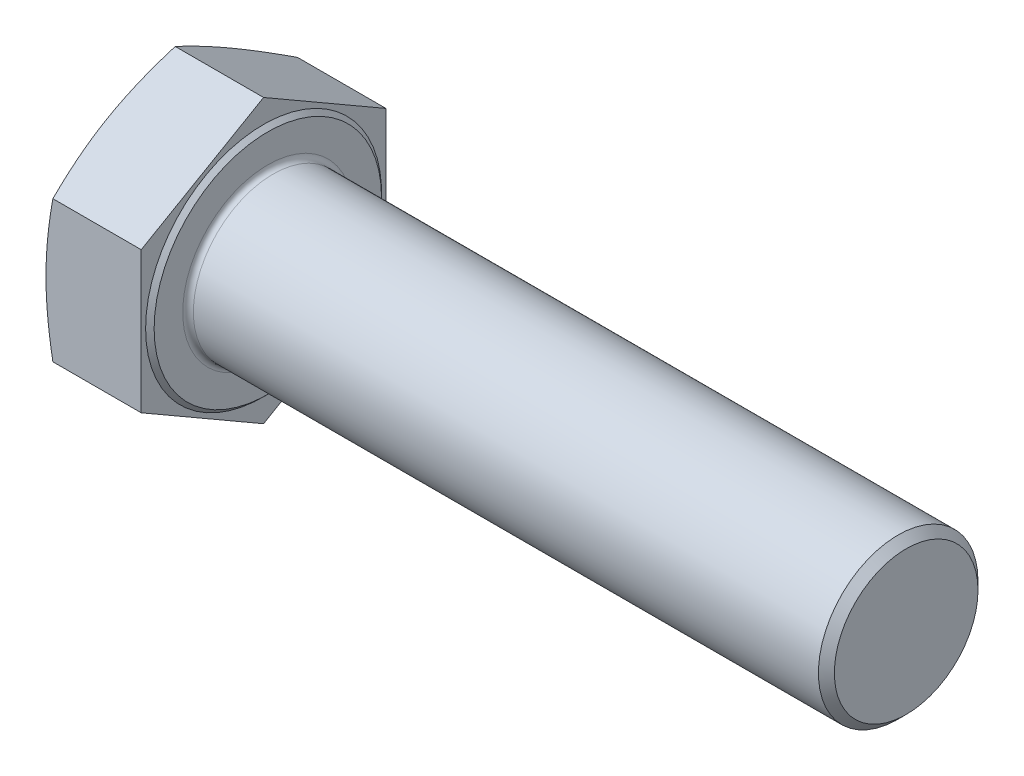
ISO-10303-21;
HEADER;
FILE_DESCRIPTION(('STEP AP214'),'2;1');
FILE_NAME('part.step','',(''),(''),'','','');
FILE_SCHEMA(('AUTOMOTIVE_DESIGN { 1 0 10303 214 1 1 1 1 }'));
ENDSEC;
DATA;
#1=APPLICATION_CONTEXT('core data for automotive mechanical design processes');
#2=APPLICATION_PROTOCOL_DEFINITION('international standard','automotive_design',2000,#1);
#3=PRODUCT_CONTEXT('',#1,'mechanical');
#4=PRODUCT('Part','Part','',(#3));
#5=PRODUCT_RELATED_PRODUCT_CATEGORY('part','',(#4));
#6=PRODUCT_DEFINITION_FORMATION('','',#4);
#7=PRODUCT_DEFINITION_CONTEXT('part definition',#1,'design');
#8=PRODUCT_DEFINITION('design','',#6,#7);
#9=PRODUCT_DEFINITION_SHAPE('','',#8);
#10=(LENGTH_UNIT() NAMED_UNIT(*) SI_UNIT(.MILLI.,.METRE.));
#11=(NAMED_UNIT(*) PLANE_ANGLE_UNIT() SI_UNIT($,.RADIAN.));
#12=(NAMED_UNIT(*) SI_UNIT($,.STERADIAN.) SOLID_ANGLE_UNIT());
#13=UNCERTAINTY_MEASURE_WITH_UNIT(LENGTH_MEASURE(1.E-05),#10,'distance_accuracy_value','');
#14=(GEOMETRIC_REPRESENTATION_CONTEXT(3) GLOBAL_UNCERTAINTY_ASSIGNED_CONTEXT((#13)) GLOBAL_UNIT_ASSIGNED_CONTEXT((#10,
#11,#12)) REPRESENTATION_CONTEXT('',''));
#15=CARTESIAN_POINT('',(0.,0.,0.));
#16=DIRECTION('',(0.,0.,1.));
#17=DIRECTION('',(1.,0.,0.));
#18=AXIS2_PLACEMENT_3D('',#15,#16,#17);
#19=CARTESIAN_POINT('',(18.7,-39.8371685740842,-23.));
#20=DIRECTION('',(1.,0.,0.));
#21=DIRECTION('',(0.,0.,-1.));
#22=AXIS2_PLACEMENT_3D('',#19,#20,#21);
#23=PLANE('',#22);
#24=CARTESIAN_POINT('',(18.7,0.,0.));
#25=DIRECTION('',(1.,0.,0.));
#26=DIRECTION('',(0.,0.,-1.));
#27=AXIS2_PLACEMENT_3D('',#24,#25,#26);
#28=CIRCLE('',#27,16.);
#29=CARTESIAN_POINT('',(18.7,0.,-16.));
#30=VERTEX_POINT('',#29);
#31=EDGE_CURVE('E11',#30,#30,#28,.F.);
#32=ORIENTED_EDGE('',*,*,#31,.T.);
#33=EDGE_LOOP('',(#32));
#34=FACE_BOUND('',#33,.T.);
#35=CARTESIAN_POINT('',(18.7,0.,0.));
#36=DIRECTION('',(-1.,0.,0.));
#37=DIRECTION('',(0.,0.,1.));
#38=AXIS2_PLACEMENT_3D('',#35,#36,#37);
#39=CIRCLE('',#38,21.375);
#40=CARTESIAN_POINT('',(18.7,0.,21.375));
#41=VERTEX_POINT('',#40);
#42=EDGE_CURVE('E263',#41,#41,#39,.T.);
#43=ORIENTED_EDGE('',*,*,#42,.F.);
#44=EDGE_LOOP('',(#43));
#45=FACE_BOUND('',#44,.T.);
#46=ADVANCED_FACE('F32',(#34,#45),#23,.T.);
#47=CARTESIAN_POINT('',(18.7,-13.2790561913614,23.));
#48=DIRECTION('',(0.,0.866025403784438,-0.5));
#49=DIRECTION('',(0.,0.5,0.866025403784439));
#50=AXIS2_PLACEMENT_3D('',#47,#48,#49);
#51=PLANE('',#50);
#52=CARTESIAN_POINT('',(1.2950890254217,-26.5582278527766,-0.00019999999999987));
#53=CARTESIAN_POINT('',(1.19500441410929,-26.2832271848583,0.476115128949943));
#54=CARTESIAN_POINT('',(1.09942088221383,-26.0078223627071,0.953130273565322));
#55=CARTESIAN_POINT('',(0.918246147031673,-25.4561668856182,1.90862558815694));
#56=CARTESIAN_POINT('',(0.83265589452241,-25.1799161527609,2.38710589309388));
#57=CARTESIAN_POINT('',(0.592277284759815,-24.349534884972,3.82536843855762));
#58=CARTESIAN_POINT('',(0.454022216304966,-23.794155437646,4.78731385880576));
#59=CARTESIAN_POINT('',(0.285997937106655,-22.9617832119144,6.22902484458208));
#60=CARTESIAN_POINT('',(0.236691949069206,-22.6857507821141,6.70712703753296));
#61=CARTESIAN_POINT('',(0.151544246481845,-22.1331705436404,7.66422408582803));
#62=CARTESIAN_POINT('',(0.115701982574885,-21.8566227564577,8.14321890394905));
#63=CARTESIAN_POINT('',(0.0581078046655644,-21.3032548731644,9.10168019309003));
#64=CARTESIAN_POINT('',(0.0363510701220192,-21.0264349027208,9.58114644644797));
#65=CARTESIAN_POINT('',(0.00729719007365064,-20.4726047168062,10.5404084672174));
#66=CARTESIAN_POINT('',(0.,-20.1955945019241,11.0202042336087));
#67=CARTESIAN_POINT('',(0.,-19.64157407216,11.9797957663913));
#68=CARTESIAN_POINT('',(0.00729719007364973,-19.364563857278,12.4595915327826));
#69=CARTESIAN_POINT('',(0.0363510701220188,-18.8107336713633,13.418853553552));
#70=CARTESIAN_POINT('',(0.0581078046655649,-18.5339137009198,13.89831980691));
#71=CARTESIAN_POINT('',(0.115701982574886,-17.9805458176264,14.8567810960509));
#72=CARTESIAN_POINT('',(0.151544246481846,-17.7039980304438,15.335775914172));
#73=CARTESIAN_POINT('',(0.236691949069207,-17.1514177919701,16.292872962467));
#74=CARTESIAN_POINT('',(0.285997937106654,-16.8753853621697,16.7709751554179));
#75=CARTESIAN_POINT('',(0.454022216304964,-16.0430131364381,18.2126861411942));
#76=CARTESIAN_POINT('',(0.592277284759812,-15.4876336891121,19.1746315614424));
#77=CARTESIAN_POINT('',(0.832655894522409,-14.6572524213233,20.6128941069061));
#78=CARTESIAN_POINT('',(0.918246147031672,-14.381001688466,21.0913744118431));
#79=CARTESIAN_POINT('',(1.09942088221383,-13.8293462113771,22.0468697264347));
#80=CARTESIAN_POINT('',(1.19500441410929,-13.5539413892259,22.5238848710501));
#81=CARTESIAN_POINT('',(1.2950890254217,-13.2789407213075,23.0002));
#82=B_SPLINE_CURVE_WITH_KNOTS('',3,(#52,#53,#54,#55,#56,#57,#58,#59,#60,#61,#62,#63,#64,#65,#66,
#67,#68,#69,#70,#71,#72,#73,#74,#75,#76,#77,#78,#79,#80,#81),.UNSPECIFIED.,.F.,.F.,(4,2,2,2,2,2,
2,2,2,2,2,2,2,2,4),(0.,1.67705053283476,3.35426049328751,6.71099893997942,8.37365469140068,
10.0362425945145,11.6982612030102,13.3602746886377,15.0222881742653,16.6843067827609,
18.3468946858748,20.009550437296,23.3662888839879,25.0434988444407,26.7205493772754),.UNSPECIFIED.);
#83=CARTESIAN_POINT('',(1.29504699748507,-26.5581123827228,0.));
#84=VERTEX_POINT('',#83);
#85=CARTESIAN_POINT('',(0.,-19.9185842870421,11.5));
#86=VERTEX_POINT('',#85);
#87=EDGE_CURVE('E277',#84,#86,#82,.T.);
#88=ORIENTED_EDGE('',*,*,#87,.F.);
#89=DIRECTION('',(-1.,0.,0.));
#90=VECTOR('',#89,1.);
#91=CARTESIAN_POINT('',(18.7,-26.5581123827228,0.));
#92=LINE('',#91,#90);
#93=CARTESIAN_POINT('',(17.9,-26.5581123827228,0.));
#94=VERTEX_POINT('',#93);
#95=EDGE_CURVE('E142',#94,#84,#92,.T.);
#96=ORIENTED_EDGE('',*,*,#95,.F.);
#97=DIRECTION('',(0.,-0.5,-0.866025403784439));
#98=VECTOR('',#97,1.);
#99=CARTESIAN_POINT('',(17.9,-13.2790561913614,23.));
#100=LINE('',#99,#98);
#101=CARTESIAN_POINT('',(17.9,-13.2790561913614,23.));
#102=VERTEX_POINT('',#101);
#103=EDGE_CURVE('E133',#102,#94,#100,.T.);
#104=ORIENTED_EDGE('',*,*,#103,.F.);
#105=DIRECTION('',(-1.,0.,0.));
#106=VECTOR('',#105,1.);
#107=CARTESIAN_POINT('',(18.7,-13.2790561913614,23.));
#108=LINE('',#107,#106);
#109=CARTESIAN_POINT('',(1.29504699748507,-13.2790561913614,23.));
#110=VERTEX_POINT('',#109);
#111=EDGE_CURVE('E128',#102,#110,#108,.T.);
#112=ORIENTED_EDGE('',*,*,#111,.T.);
#113=EDGE_CURVE('E121',#86,#110,#82,.T.);
#114=ORIENTED_EDGE('',*,*,#113,.F.);
#115=EDGE_LOOP('',(#88,#96,#104,#112,#114));
#116=FACE_BOUND('',#115,.T.);
#117=ADVANCED_FACE('F34',(#116),#51,.F.);
#118=CARTESIAN_POINT('',(18.7,-26.5581123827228,0.));
#119=DIRECTION('',(0.,0.866025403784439,0.5));
#120=DIRECTION('',(0.,-0.5,0.866025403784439));
#121=AXIS2_PLACEMENT_3D('',#118,#119,#120);
#122=PLANE('',#121);
#123=CARTESIAN_POINT('',(1.2950890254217,-13.2789407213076,-23.0002));
#124=CARTESIAN_POINT('',(1.1950044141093,-13.5539413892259,-22.52388487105));
#125=CARTESIAN_POINT('',(1.09942088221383,-13.8293462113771,-22.0468697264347));
#126=CARTESIAN_POINT('',(0.918246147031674,-14.381001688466,-21.0913744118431));
#127=CARTESIAN_POINT('',(0.83265589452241,-14.6572524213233,-20.6128941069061));
#128=CARTESIAN_POINT('',(0.592277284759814,-15.4876336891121,-19.1746315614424));
#129=CARTESIAN_POINT('',(0.454022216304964,-16.0430131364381,-18.2126861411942));
#130=CARTESIAN_POINT('',(0.285997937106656,-16.8753853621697,-16.7709751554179));
#131=CARTESIAN_POINT('',(0.236691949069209,-17.1514177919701,-16.292872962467));
#132=CARTESIAN_POINT('',(0.151544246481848,-17.7039980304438,-15.335775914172));
#133=CARTESIAN_POINT('',(0.115701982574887,-17.9805458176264,-14.8567810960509));
#134=CARTESIAN_POINT('',(0.0581078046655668,-18.5339137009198,-13.89831980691));
#135=CARTESIAN_POINT('',(0.0363510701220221,-18.8107336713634,-13.418853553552));
#136=CARTESIAN_POINT('',(0.00729719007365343,-19.364563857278,-12.4595915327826));
#137=CARTESIAN_POINT('',(0.,-19.64157407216,-11.9797957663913));
#138=CARTESIAN_POINT('',(0.,-20.1955945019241,-11.0202042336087));
#139=CARTESIAN_POINT('',(0.00729719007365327,-20.4726047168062,-10.5404084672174));
#140=CARTESIAN_POINT('',(0.0363510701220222,-21.0264349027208,-9.58114644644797));
#141=CARTESIAN_POINT('',(0.0581078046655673,-21.3032548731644,-9.10168019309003));
#142=CARTESIAN_POINT('',(0.115701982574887,-21.8566227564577,-8.14321890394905));
#143=CARTESIAN_POINT('',(0.151544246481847,-22.1331705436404,-7.66422408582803));
#144=CARTESIAN_POINT('',(0.236691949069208,-22.6857507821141,-6.70712703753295));
#145=CARTESIAN_POINT('',(0.285997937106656,-22.9617832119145,-6.22902484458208));
#146=CARTESIAN_POINT('',(0.454022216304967,-23.794155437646,-4.78731385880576));
#147=CARTESIAN_POINT('',(0.592277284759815,-24.349534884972,-3.82536843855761));
#148=CARTESIAN_POINT('',(0.832655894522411,-25.1799161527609,-2.38710589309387));
#149=CARTESIAN_POINT('',(0.918246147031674,-25.4561668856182,-1.90862558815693));
#150=CARTESIAN_POINT('',(1.09942088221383,-26.0078223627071,-0.953130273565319));
#151=CARTESIAN_POINT('',(1.1950044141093,-26.2832271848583,-0.476115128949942));
#152=CARTESIAN_POINT('',(1.2950890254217,-26.5582278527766,0.000200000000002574));
#153=B_SPLINE_CURVE_WITH_KNOTS('',3,(#123,#124,#125,#126,#127,#128,#129,#130,#131,#132,#133,
#134,#135,#136,#137,#138,#139,#140,#141,#142,#143,#144,#145,#146,#147,#148,#149,#150,#151,#152),
.UNSPECIFIED.,.F.,.F.,(4,2,2,2,2,2,2,2,2,2,2,2,2,2,4),(0.,1.67705053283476,3.3542604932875,
6.71099893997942,8.37365469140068,10.0362425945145,11.6982612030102,13.3602746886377,
15.0222881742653,16.6843067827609,18.3468946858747,20.009550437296,23.3662888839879,
25.0434988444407,26.7205493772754),.UNSPECIFIED.);
#154=CARTESIAN_POINT('',(1.29504699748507,-13.2790561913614,-23.));
#155=VERTEX_POINT('',#154);
#156=CARTESIAN_POINT('',(0.,-19.9185842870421,-11.5));
#157=VERTEX_POINT('',#156);
#158=EDGE_CURVE('E230',#155,#157,#153,.T.);
#159=ORIENTED_EDGE('',*,*,#158,.F.);
#160=DIRECTION('',(-1.,0.,0.));
#161=VECTOR('',#160,1.);
#162=CARTESIAN_POINT('',(18.7,-13.2790561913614,-23.));
#163=LINE('',#162,#161);
#164=CARTESIAN_POINT('',(17.9,-13.2790561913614,-23.));
#165=VERTEX_POINT('',#164);
#166=EDGE_CURVE('E139',#165,#155,#163,.T.);
#167=ORIENTED_EDGE('',*,*,#166,.F.);
#168=DIRECTION('',(0.,0.5,-0.866025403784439));
#169=VECTOR('',#168,1.);
#170=CARTESIAN_POINT('',(17.9,-26.5581123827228,0.));
#171=LINE('',#170,#169);
#172=EDGE_CURVE('E267',#94,#165,#171,.T.);
#173=ORIENTED_EDGE('',*,*,#172,.F.);
#174=ORIENTED_EDGE('',*,*,#95,.T.);
#175=EDGE_CURVE('E226',#157,#84,#153,.T.);
#176=ORIENTED_EDGE('',*,*,#175,.F.);
#177=EDGE_LOOP('',(#159,#167,#173,#174,#176));
#178=FACE_BOUND('',#177,.T.);
#179=ADVANCED_FACE('F180',(#178),#122,.F.);
#180=CARTESIAN_POINT('',(18.7,-13.2790561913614,-23.));
#181=DIRECTION('',(0.,0.,1.));
#182=DIRECTION('',(0.,-1.,0.));
#183=AXIS2_PLACEMENT_3D('',#180,#181,#182);
#184=PLANE('',#183);
#185=CARTESIAN_POINT('',(6.92021756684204,-35.158271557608,-23.));
#186=CARTESIAN_POINT('',(6.76174720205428,-34.6379776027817,-23.));
#187=CARTESIAN_POINT('',(6.60423519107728,-34.1173919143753,-23.));
#188=CARTESIAN_POINT('',(6.29134242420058,-33.0755772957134,-23.));
#189=CARTESIAN_POINT('',(6.13596168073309,-32.554348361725,-23.));
#190=CARTESIAN_POINT('',(5.67331813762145,-30.9895390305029,-23.));
#191=CARTESIAN_POINT('',(5.36957751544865,-29.9449130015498,-23.));
#192=CARTESIAN_POINT('',(4.77309635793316,-27.850409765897,-23.));
#193=CARTESIAN_POINT('',(4.48037740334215,-26.8005263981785,-23.));
#194=CARTESIAN_POINT('',(3.90934144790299,-24.6968547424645,-23.));
#195=CARTESIAN_POINT('',(3.63102418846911,-23.6430665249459,-23.));
#196=CARTESIAN_POINT('',(3.0956871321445,-21.5439040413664,-23.));
#197=CARTESIAN_POINT('',(2.83844705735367,-20.498586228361,-23.));
#198=CARTESIAN_POINT('',(2.34586746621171,-18.4027490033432,-23.));
#199=CARTESIAN_POINT('',(2.11052831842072,-17.3522295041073,-23.));
#200=CARTESIAN_POINT('',(1.66723776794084,-15.2457537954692,-23.));
#201=CARTESIAN_POINT('',(1.45927702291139,-14.1897995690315,-23.));
#202=CARTESIAN_POINT('',(1.07707549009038,-12.0717605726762,-23.));
#203=CARTESIAN_POINT('',(0.902833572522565,-11.0096760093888,-23.));
#204=CARTESIAN_POINT('',(0.612400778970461,-8.99897122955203,-23.));
#205=CARTESIAN_POINT('',(0.491891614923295,-8.05098062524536,-23.));
#206=CARTESIAN_POINT('',(0.28789830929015,-6.15099084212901,-23.));
#207=CARTESIAN_POINT('',(0.204413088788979,-5.19899178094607,-23.));
#208=CARTESIAN_POINT('',(0.0784881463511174,-3.29291608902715,-23.));
#209=CARTESIAN_POINT('',(0.0360193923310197,-2.33884140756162,-23.));
#210=CARTESIAN_POINT('',(-0.00572242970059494,-0.429737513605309,-23.));
#211=CARTESIAN_POINT('',(-0.0049958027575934,0.525291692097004,-23.));
#212=CARTESIAN_POINT('',(0.0397267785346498,2.43916569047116,-23.));
#213=CARTESIAN_POINT('',(0.0839421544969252,3.39800527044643,-23.));
#214=CARTESIAN_POINT('',(0.213607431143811,5.31286807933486,-23.));
#215=CARTESIAN_POINT('',(0.299058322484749,6.26889124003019,-23.));
#216=CARTESIAN_POINT('',(0.507197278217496,8.17764914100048,-23.));
#217=CARTESIAN_POINT('',(0.629917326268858,9.13038034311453,-23.));
#218=CARTESIAN_POINT('',(0.907616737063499,11.0310764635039,-23.));
#219=CARTESIAN_POINT('',(1.06259627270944,11.9790413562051,-23.));
#220=CARTESIAN_POINT('',(1.40868878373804,13.9200882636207,-23.));
#221=CARTESIAN_POINT('',(1.60127942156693,14.912904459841,-23.));
#222=CARTESIAN_POINT('',(2.01124825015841,16.893438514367,-23.));
#223=CARTESIAN_POINT('',(2.22862830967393,17.88115598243,-23.));
#224=CARTESIAN_POINT('',(2.68361144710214,19.8521964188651,-23.));
#225=CARTESIAN_POINT('',(2.92122039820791,20.8355180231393,-23.));
#226=CARTESIAN_POINT('',(3.41279612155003,22.798018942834,-23.));
#227=CARTESIAN_POINT('',(3.6667625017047,23.7771983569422,-23.));
#228=CARTESIAN_POINT('',(4.18833020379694,25.7332530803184,-23.));
#229=CARTESIAN_POINT('',(4.45594861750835,26.7101238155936,-23.));
#230=CARTESIAN_POINT('',(5.00207188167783,28.660813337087,-23.));
#231=CARTESIAN_POINT('',(5.28057677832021,29.6346321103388,-23.));
#232=CARTESIAN_POINT('',(5.84648042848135,31.5794991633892,-23.));
#233=CARTESIAN_POINT('',(6.13387768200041,32.5505478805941,-23.));
#234=CARTESIAN_POINT('',(6.71606550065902,34.4904204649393,-23.));
#235=CARTESIAN_POINT('',(7.01085605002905,35.4592443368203,-23.));
#236=CARTESIAN_POINT('',(7.60331032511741,37.3843072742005,-23.));
#237=CARTESIAN_POINT('',(7.90090639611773,38.3405671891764,-23.));
#238=CARTESIAN_POINT('',(8.501167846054,40.2514931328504,-23.));
#239=CARTESIAN_POINT('',(8.80383322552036,41.2061591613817,-23.));
#240=CARTESIAN_POINT('',(9.4134719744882,43.114161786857,-23.));
#241=CARTESIAN_POINT('',(9.7204455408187,44.0674983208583,-23.));
#242=CARTESIAN_POINT('',(10.3380556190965,45.9729843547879,-23.));
#243=CARTESIAN_POINT('',(10.6486921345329,46.9251338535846,-23.));
#244=CARTESIAN_POINT('',(11.2719240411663,48.824788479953,-23.));
#245=CARTESIAN_POINT('',(11.5845075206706,49.7722975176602,-23.));
#246=CARTESIAN_POINT('',(12.2123718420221,51.6664216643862,-23.));
#247=CARTESIAN_POINT('',(12.5276526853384,52.6130367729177,-23.));
#248=CARTESIAN_POINT('',(13.1605303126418,54.5054059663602,-23.));
#249=CARTESIAN_POINT('',(13.4781269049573,55.4511601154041,-23.));
#250=CARTESIAN_POINT('',(14.1153751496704,57.3419733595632,-23.));
#251=CARTESIAN_POINT('',(14.4350267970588,58.2870324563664,-23.));
#252=CARTESIAN_POINT('',(14.7555635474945,59.2317905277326,-23.));
#253=B_SPLINE_CURVE_WITH_KNOTS('',3,(#185,#186,#187,#188,#189,#190,#191,#192,#193,#194,#195,
#196,#197,#198,#199,#200,#201,#202,#203,#204,#205,#206,#207,#208,#209,#210,#211,#212,#213,#214,
#215,#216,#217,#218,#219,#220,#221,#222,#223,#224,#225,#226,#227,#228,#229,#230,#231,#232,#233,
#234,#235,#236,#237,#238,#239,#240,#241,#242,#243,#244,#245,#246,#247,#248,#249,#250,#251,#252),
.UNSPECIFIED.,.F.,.F.,(4,2,2,2,2,2,2,2,2,2,2,2,2,2,2,2,2,2,2,2,2,2,2,2,2,2,2,2,2,2,2,2,2,4),(0.,
1.63167467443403,3.26335886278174,6.52696844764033,9.7966671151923,13.0663070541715,
16.2956340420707,19.5250153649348,22.7532918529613,25.9814601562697,28.8476892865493,
31.7138348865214,34.5779502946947,37.4420454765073,40.3206659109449,43.1993555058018,
46.0805225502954,48.9617050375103,51.9952874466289,55.0290986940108,58.0637937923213,
61.0984161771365,64.1369357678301,67.1754682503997,70.2134909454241,73.2515071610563,
76.2559819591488,79.2604570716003,82.2650698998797,85.2696855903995,88.2628960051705,
91.2561080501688,94.249075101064,97.2420348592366),.UNSPECIFIED.);
#254=CARTESIAN_POINT('',(1.29504699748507,13.2790561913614,-23.));
#255=VERTEX_POINT('',#254);
#256=CARTESIAN_POINT('',(0.,0.,-23.));
#257=VERTEX_POINT('',#256);
#258=EDGE_CURVE('E293',#255,#257,#253,.F.);
#259=ORIENTED_EDGE('',*,*,#258,.F.);
#260=DIRECTION('',(-1.,0.,0.));
#261=VECTOR('',#260,1.);
#262=CARTESIAN_POINT('',(18.7,13.2790561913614,-23.));
#263=LINE('',#262,#261);
#264=CARTESIAN_POINT('',(17.9,13.2790561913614,-23.));
#265=VERTEX_POINT('',#264);
#266=EDGE_CURVE('E130',#265,#255,#263,.T.);
#267=ORIENTED_EDGE('',*,*,#266,.F.);
#268=DIRECTION('',(0.,1.,0.));
#269=VECTOR('',#268,1.);
#270=CARTESIAN_POINT('',(17.9,-13.2790561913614,-23.));
#271=LINE('',#270,#269);
#272=EDGE_CURVE('E260',#165,#265,#271,.T.);
#273=ORIENTED_EDGE('',*,*,#272,.F.);
#274=ORIENTED_EDGE('',*,*,#166,.T.);
#275=EDGE_CURVE('E231',#257,#155,#253,.F.);
#276=ORIENTED_EDGE('',*,*,#275,.F.);
#277=EDGE_LOOP('',(#259,#267,#273,#274,#276));
#278=FACE_BOUND('',#277,.T.);
#279=ADVANCED_FACE('F239',(#278),#184,.F.);
#280=CARTESIAN_POINT('',(18.7,13.2790561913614,-23.));
#281=DIRECTION('',(0.,-0.866025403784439,0.5));
#282=DIRECTION('',(0.,-0.5,-0.866025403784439));
#283=AXIS2_PLACEMENT_3D('',#280,#281,#282);
#284=PLANE('',#283);
#285=CARTESIAN_POINT('',(1.2950890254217,26.5582278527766,0.00019999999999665));
#286=CARTESIAN_POINT('',(1.1950044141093,26.2832271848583,-0.476115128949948));
#287=CARTESIAN_POINT('',(1.09942088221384,26.0078223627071,-0.953130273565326));
#288=CARTESIAN_POINT('',(0.918246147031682,25.4561668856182,-1.90862558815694));
#289=CARTESIAN_POINT('',(0.832655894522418,25.1799161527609,-2.38710589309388));
#290=CARTESIAN_POINT('',(0.592277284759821,24.3495348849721,-3.82536843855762));
#291=CARTESIAN_POINT('',(0.454022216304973,23.7941554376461,-4.78731385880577));
#292=CARTESIAN_POINT('',(0.285997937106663,22.9617832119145,-6.22902484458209));
#293=CARTESIAN_POINT('',(0.236691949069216,22.6857507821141,-6.70712703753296));
#294=CARTESIAN_POINT('',(0.151544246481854,22.1331705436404,-7.66422408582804));
#295=CARTESIAN_POINT('',(0.115701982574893,21.8566227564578,-8.14321890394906));
#296=CARTESIAN_POINT('',(0.0581078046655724,21.3032548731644,-9.10168019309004));
#297=CARTESIAN_POINT('',(0.0363510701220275,21.0264349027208,-9.58114644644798));
#298=CARTESIAN_POINT('',(0.00729719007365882,20.4726047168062,-10.5404084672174));
#299=CARTESIAN_POINT('',(0.,20.1955945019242,-11.0202042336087));
#300=CARTESIAN_POINT('',(0.,19.6415740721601,-11.9797957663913));
#301=CARTESIAN_POINT('',(0.00729719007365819,19.364563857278,-12.4595915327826));
#302=CARTESIAN_POINT('',(0.0363510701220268,18.8107336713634,-13.418853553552));
#303=CARTESIAN_POINT('',(0.058107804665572,18.5339137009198,-13.89831980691));
#304=CARTESIAN_POINT('',(0.115701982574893,17.9805458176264,-14.8567810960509));
#305=CARTESIAN_POINT('',(0.151544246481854,17.7039980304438,-15.335775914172));
#306=CARTESIAN_POINT('',(0.236691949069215,17.1514177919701,-16.292872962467));
#307=CARTESIAN_POINT('',(0.285997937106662,16.8753853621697,-16.7709751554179));
#308=CARTESIAN_POINT('',(0.454022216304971,16.0430131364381,-18.2126861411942));
#309=CARTESIAN_POINT('',(0.59227728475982,15.4876336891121,-19.1746315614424));
#310=CARTESIAN_POINT('',(0.832655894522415,14.6572524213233,-20.6128941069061));
#311=CARTESIAN_POINT('',(0.918246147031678,14.381001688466,-21.0913744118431));
#312=CARTESIAN_POINT('',(1.09942088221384,13.8293462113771,-22.0468697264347));
#313=CARTESIAN_POINT('',(1.1950044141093,13.5539413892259,-22.5238848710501));
#314=CARTESIAN_POINT('',(1.2950890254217,13.2789407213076,-23.0002));
#315=B_SPLINE_CURVE_WITH_KNOTS('',3,(#285,#286,#287,#288,#289,#290,#291,#292,#293,#294,#295,
#296,#297,#298,#299,#300,#301,#302,#303,#304,#305,#306,#307,#308,#309,#310,#311,#312,#313,#314),
.UNSPECIFIED.,.F.,.F.,(4,2,2,2,2,2,2,2,2,2,2,2,2,2,4),(0.,1.67705053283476,3.3542604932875,
6.71099893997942,8.37365469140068,10.0362425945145,11.6982612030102,13.3602746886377,
15.0222881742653,16.6843067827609,18.3468946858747,20.009550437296,23.3662888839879,
25.0434988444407,26.7205493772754),.UNSPECIFIED.);
#316=CARTESIAN_POINT('',(1.29504699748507,26.5581123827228,0.));
#317=VERTEX_POINT('',#316);
#318=CARTESIAN_POINT('',(0.,19.9185842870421,-11.5));
#319=VERTEX_POINT('',#318);
#320=EDGE_CURVE('E48',#317,#319,#315,.T.);
#321=ORIENTED_EDGE('',*,*,#320,.F.);
#322=DIRECTION('',(-1.,0.,0.));
#323=VECTOR('',#322,1.);
#324=CARTESIAN_POINT('',(18.7,26.5581123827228,0.));
#325=LINE('',#324,#323);
#326=CARTESIAN_POINT('',(17.9,26.5581123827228,0.));
#327=VERTEX_POINT('',#326);
#328=EDGE_CURVE('E127',#327,#317,#325,.T.);
#329=ORIENTED_EDGE('',*,*,#328,.F.);
#330=DIRECTION('',(0.,0.5,0.866025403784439));
#331=VECTOR('',#330,1.);
#332=CARTESIAN_POINT('',(17.9,13.2790561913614,-23.));
#333=LINE('',#332,#331);
#334=EDGE_CURVE('E257',#265,#327,#333,.T.);
#335=ORIENTED_EDGE('',*,*,#334,.F.);
#336=ORIENTED_EDGE('',*,*,#266,.T.);
#337=EDGE_CURVE('E254',#319,#255,#315,.T.);
#338=ORIENTED_EDGE('',*,*,#337,.F.);
#339=EDGE_LOOP('',(#321,#329,#335,#336,#338));
#340=FACE_BOUND('',#339,.T.);
#341=ADVANCED_FACE('F243',(#340),#284,.F.);
#342=CARTESIAN_POINT('',(18.7,26.5581123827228,0.));
#343=DIRECTION('',(0.,-0.866025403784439,-0.5));
#344=DIRECTION('',(0.,0.5,-0.866025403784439));
#345=AXIS2_PLACEMENT_3D('',#342,#343,#344);
#346=PLANE('',#345);
#347=CARTESIAN_POINT('',(1.2950890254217,13.2789407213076,23.0002));
#348=CARTESIAN_POINT('',(1.1950044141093,13.5539413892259,22.5238848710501));
#349=CARTESIAN_POINT('',(1.09942088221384,13.8293462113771,22.0468697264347));
#350=CARTESIAN_POINT('',(0.91824614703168,14.381001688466,21.0913744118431));
#351=CARTESIAN_POINT('',(0.832655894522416,14.6572524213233,20.6128941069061));
#352=CARTESIAN_POINT('',(0.59227728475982,15.4876336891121,19.1746315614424));
#353=CARTESIAN_POINT('',(0.454022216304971,16.0430131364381,18.2126861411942));
#354=CARTESIAN_POINT('',(0.285997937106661,16.8753853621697,16.7709751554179));
#355=CARTESIAN_POINT('',(0.236691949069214,17.1514177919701,16.292872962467));
#356=CARTESIAN_POINT('',(0.151544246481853,17.7039980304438,15.335775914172));
#357=CARTESIAN_POINT('',(0.115701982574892,17.9805458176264,14.8567810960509));
#358=CARTESIAN_POINT('',(0.0581078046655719,18.5339137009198,13.89831980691));
#359=CARTESIAN_POINT('',(0.0363510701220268,18.8107336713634,13.418853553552));
#360=CARTESIAN_POINT('',(0.00729719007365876,19.364563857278,12.4595915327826));
#361=CARTESIAN_POINT('',(0.,19.6415740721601,11.9797957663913));
#362=CARTESIAN_POINT('',(0.,20.1955945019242,11.0202042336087));
#363=CARTESIAN_POINT('',(0.00729719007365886,20.4726047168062,10.5404084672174));
#364=CARTESIAN_POINT('',(0.0363510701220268,21.0264349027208,9.58114644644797));
#365=CARTESIAN_POINT('',(0.0581078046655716,21.3032548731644,9.10168019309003));
#366=CARTESIAN_POINT('',(0.115701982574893,21.8566227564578,8.14321890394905));
#367=CARTESIAN_POINT('',(0.151544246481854,22.1331705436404,7.66422408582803));
#368=CARTESIAN_POINT('',(0.236691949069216,22.6857507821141,6.70712703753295));
#369=CARTESIAN_POINT('',(0.285997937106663,22.9617832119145,6.22902484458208));
#370=CARTESIAN_POINT('',(0.454022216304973,23.7941554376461,4.78731385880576));
#371=CARTESIAN_POINT('',(0.592277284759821,24.3495348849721,3.82536843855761));
#372=CARTESIAN_POINT('',(0.832655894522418,25.1799161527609,2.38710589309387));
#373=CARTESIAN_POINT('',(0.918246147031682,25.4561668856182,1.90862558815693));
#374=CARTESIAN_POINT('',(1.09942088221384,26.0078223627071,0.953130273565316));
#375=CARTESIAN_POINT('',(1.1950044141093,26.2832271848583,0.476115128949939));
#376=CARTESIAN_POINT('',(1.2950890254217,26.5582278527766,-0.00020000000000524));
#377=B_SPLINE_CURVE_WITH_KNOTS('',3,(#347,#348,#349,#350,#351,#352,#353,#354,#355,#356,#357,
#358,#359,#360,#361,#362,#363,#364,#365,#366,#367,#368,#369,#370,#371,#372,#373,#374,#375,#376),
.UNSPECIFIED.,.F.,.F.,(4,2,2,2,2,2,2,2,2,2,2,2,2,2,4),(0.,1.67705053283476,3.3542604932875,
6.71099893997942,8.37365469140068,10.0362425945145,11.6982612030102,13.3602746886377,
15.0222881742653,16.6843067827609,18.3468946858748,20.009550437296,23.3662888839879,
25.0434988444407,26.7205493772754),.UNSPECIFIED.);
#378=CARTESIAN_POINT('',(1.29504699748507,13.2790561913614,23.));
#379=VERTEX_POINT('',#378);
#380=CARTESIAN_POINT('',(0.,19.9185842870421,11.5));
#381=VERTEX_POINT('',#380);
#382=EDGE_CURVE('E56',#379,#381,#377,.T.);
#383=ORIENTED_EDGE('',*,*,#382,.F.);
#384=DIRECTION('',(-1.,0.,0.));
#385=VECTOR('',#384,1.);
#386=CARTESIAN_POINT('',(18.7,13.2790561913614,23.));
#387=LINE('',#386,#385);
#388=CARTESIAN_POINT('',(17.9,13.2790561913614,23.));
#389=VERTEX_POINT('',#388);
#390=EDGE_CURVE('E118',#389,#379,#387,.T.);
#391=ORIENTED_EDGE('',*,*,#390,.F.);
#392=DIRECTION('',(0.,-0.5,0.866025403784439));
#393=VECTOR('',#392,1.);
#394=CARTESIAN_POINT('',(17.9,26.5581123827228,0.));
#395=LINE('',#394,#393);
#396=EDGE_CURVE('E255',#327,#389,#395,.T.);
#397=ORIENTED_EDGE('',*,*,#396,.F.);
#398=ORIENTED_EDGE('',*,*,#328,.T.);
#399=EDGE_CURVE('E120',#381,#317,#377,.T.);
#400=ORIENTED_EDGE('',*,*,#399,.F.);
#401=EDGE_LOOP('',(#383,#391,#397,#398,#400));
#402=FACE_BOUND('',#401,.T.);
#403=ADVANCED_FACE('F116',(#402),#346,.F.);
#404=CARTESIAN_POINT('',(18.7,13.2790561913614,23.));
#405=DIRECTION('',(0.,0.,-1.));
#406=DIRECTION('',(-1.,0.,0.));
#407=AXIS2_PLACEMENT_3D('',#404,#405,#406);
#408=PLANE('',#407);
#409=CARTESIAN_POINT('',(6.92021756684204,-35.158271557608,23.));
#410=CARTESIAN_POINT('',(6.76174720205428,-34.6379776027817,23.));
#411=CARTESIAN_POINT('',(6.60423519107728,-34.1173919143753,23.));
#412=CARTESIAN_POINT('',(6.29134242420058,-33.0755772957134,23.));
#413=CARTESIAN_POINT('',(6.13596168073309,-32.554348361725,23.));
#414=CARTESIAN_POINT('',(5.67331813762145,-30.9895390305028,23.));
#415=CARTESIAN_POINT('',(5.36957751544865,-29.9449130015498,23.));
#416=CARTESIAN_POINT('',(4.77309635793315,-27.850409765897,23.));
#417=CARTESIAN_POINT('',(4.48037740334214,-26.8005263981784,23.));
#418=CARTESIAN_POINT('',(3.90934144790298,-24.6968547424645,23.));
#419=CARTESIAN_POINT('',(3.6310241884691,-23.6430665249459,23.));
#420=CARTESIAN_POINT('',(3.0956871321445,-21.5439040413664,23.));
#421=CARTESIAN_POINT('',(2.83844705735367,-20.498586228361,23.));
#422=CARTESIAN_POINT('',(2.34586746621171,-18.4027490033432,23.));
#423=CARTESIAN_POINT('',(2.11052831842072,-17.3522295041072,23.));
#424=CARTESIAN_POINT('',(1.66723776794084,-15.2457537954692,23.));
#425=CARTESIAN_POINT('',(1.45927702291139,-14.1897995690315,23.));
#426=CARTESIAN_POINT('',(1.07707549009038,-12.0717605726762,23.));
#427=CARTESIAN_POINT('',(0.902833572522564,-11.0096760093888,23.));
#428=CARTESIAN_POINT('',(0.61240077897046,-8.99897122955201,23.));
#429=CARTESIAN_POINT('',(0.491891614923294,-8.05098062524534,23.));
#430=CARTESIAN_POINT('',(0.28789830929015,-6.15099084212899,23.));
#431=CARTESIAN_POINT('',(0.204413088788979,-5.19899178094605,23.));
#432=CARTESIAN_POINT('',(0.078488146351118,-3.29291608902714,23.));
#433=CARTESIAN_POINT('',(0.0360193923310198,-2.3388414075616,23.));
#434=CARTESIAN_POINT('',(-0.00572242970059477,-0.42973751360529,23.));
#435=CARTESIAN_POINT('',(-0.00499580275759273,0.525291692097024,23.));
#436=CARTESIAN_POINT('',(0.0397267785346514,2.43916569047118,23.));
#437=CARTESIAN_POINT('',(0.0839421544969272,3.39800527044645,23.));
#438=CARTESIAN_POINT('',(0.213607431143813,5.31286807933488,23.));
#439=CARTESIAN_POINT('',(0.299058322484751,6.2688912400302,23.));
#440=CARTESIAN_POINT('',(0.507197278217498,8.1776491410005,23.));
#441=CARTESIAN_POINT('',(0.62991732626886,9.13038034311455,23.));
#442=CARTESIAN_POINT('',(0.907616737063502,11.0310764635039,23.));
#443=CARTESIAN_POINT('',(1.06259627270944,11.9790413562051,23.));
#444=CARTESIAN_POINT('',(1.40868878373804,13.9200882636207,23.));
#445=CARTESIAN_POINT('',(1.60127942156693,14.912904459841,23.));
#446=CARTESIAN_POINT('',(2.01124825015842,16.893438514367,23.));
#447=CARTESIAN_POINT('',(2.22862830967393,17.88115598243,23.));
#448=CARTESIAN_POINT('',(2.68361144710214,19.8521964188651,23.));
#449=CARTESIAN_POINT('',(2.92122039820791,20.8355180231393,23.));
#450=CARTESIAN_POINT('',(3.41279612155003,22.798018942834,23.));
#451=CARTESIAN_POINT('',(3.6667625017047,23.7771983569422,23.));
#452=CARTESIAN_POINT('',(4.18833020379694,25.7332530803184,23.));
#453=CARTESIAN_POINT('',(4.45594861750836,26.7101238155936,23.));
#454=CARTESIAN_POINT('',(5.00207188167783,28.660813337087,23.));
#455=CARTESIAN_POINT('',(5.28057677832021,29.6346321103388,23.));
#456=CARTESIAN_POINT('',(5.84648042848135,31.5794991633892,23.));
#457=CARTESIAN_POINT('',(6.13387768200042,32.5505478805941,23.));
#458=CARTESIAN_POINT('',(6.71606550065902,34.4904204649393,23.));
#459=CARTESIAN_POINT('',(7.01085605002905,35.4592443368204,23.));
#460=CARTESIAN_POINT('',(7.60331032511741,37.3843072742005,23.));
#461=CARTESIAN_POINT('',(7.90090639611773,38.3405671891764,23.));
#462=CARTESIAN_POINT('',(8.501167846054,40.2514931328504,23.));
#463=CARTESIAN_POINT('',(8.80383322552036,41.2061591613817,23.));
#464=CARTESIAN_POINT('',(9.4134719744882,43.114161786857,23.));
#465=CARTESIAN_POINT('',(9.72044554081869,44.0674983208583,23.));
#466=CARTESIAN_POINT('',(10.3380556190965,45.9729843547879,23.));
#467=CARTESIAN_POINT('',(10.6486921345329,46.9251338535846,23.));
#468=CARTESIAN_POINT('',(11.2719240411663,48.824788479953,23.));
#469=CARTESIAN_POINT('',(11.5845075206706,49.7722975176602,23.));
#470=CARTESIAN_POINT('',(12.2123718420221,51.6664216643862,23.));
#471=CARTESIAN_POINT('',(12.5276526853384,52.6130367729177,23.));
#472=CARTESIAN_POINT('',(13.1605303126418,54.5054059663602,23.));
#473=CARTESIAN_POINT('',(13.4781269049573,55.4511601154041,23.));
#474=CARTESIAN_POINT('',(14.1153751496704,57.3419733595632,23.));
#475=CARTESIAN_POINT('',(14.4350267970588,58.2870324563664,23.));
#476=CARTESIAN_POINT('',(14.7555635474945,59.2317905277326,23.));
#477=B_SPLINE_CURVE_WITH_KNOTS('',3,(#409,#410,#411,#412,#413,#414,#415,#416,#417,#418,#419,
#420,#421,#422,#423,#424,#425,#426,#427,#428,#429,#430,#431,#432,#433,#434,#435,#436,#437,#438,
#439,#440,#441,#442,#443,#444,#445,#446,#447,#448,#449,#450,#451,#452,#453,#454,#455,#456,#457,
#458,#459,#460,#461,#462,#463,#464,#465,#466,#467,#468,#469,#470,#471,#472,#473,#474,#475,#476),
.UNSPECIFIED.,.F.,.F.,(4,2,2,2,2,2,2,2,2,2,2,2,2,2,2,2,2,2,2,2,2,2,2,2,2,2,2,2,2,2,2,2,2,4),(0.,
1.63167467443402,3.26335886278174,6.52696844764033,9.7966671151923,13.0663070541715,
16.2956340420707,19.5250153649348,22.7532918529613,25.9814601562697,28.8476892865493,
31.7138348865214,34.5779502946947,37.4420454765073,40.3206659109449,43.1993555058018,
46.0805225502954,48.9617050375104,51.9952874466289,55.0290986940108,58.0637937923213,
61.0984161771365,64.1369357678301,67.1754682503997,70.2134909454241,73.2515071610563,
76.2559819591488,79.2604570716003,82.2650698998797,85.2696855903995,88.2628960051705,
91.2561080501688,94.2490751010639,97.2420348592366),.UNSPECIFIED.);
#478=CARTESIAN_POINT('',(0.,0.,23.));
#479=VERTEX_POINT('',#478);
#480=EDGE_CURVE('E111',#110,#479,#477,.T.);
#481=ORIENTED_EDGE('',*,*,#480,.F.);
#482=ORIENTED_EDGE('',*,*,#111,.F.);
#483=DIRECTION('',(0.,-1.,0.));
#484=VECTOR('',#483,1.);
#485=CARTESIAN_POINT('',(17.9,13.2790561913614,23.));
#486=LINE('',#485,#484);
#487=EDGE_CURVE('E126',#389,#102,#486,.T.);
#488=ORIENTED_EDGE('',*,*,#487,.F.);
#489=ORIENTED_EDGE('',*,*,#390,.T.);
#490=EDGE_CURVE('E103',#479,#379,#477,.T.);
#491=ORIENTED_EDGE('',*,*,#490,.F.);
#492=EDGE_LOOP('',(#481,#482,#488,#489,#491));
#493=FACE_BOUND('',#492,.T.);
#494=ADVANCED_FACE('F124',(#493),#408,.F.);
#495=CARTESIAN_POINT('',(17.9,22.175,0.));
#496=DIRECTION('',(1.,0.,0.));
#497=DIRECTION('',(0.,0.,-1.));
#498=AXIS2_PLACEMENT_3D('',#495,#496,#497);
#499=PLANE('',#498);
#500=CARTESIAN_POINT('',(17.9,0.,0.));
#501=DIRECTION('',(-1.,0.,0.));
#502=DIRECTION('',(0.,0.,1.));
#503=AXIS2_PLACEMENT_3D('',#500,#501,#502);
#504=CIRCLE('',#503,22.175);
#505=CARTESIAN_POINT('',(17.9,0.,22.175));
#506=VERTEX_POINT('',#505);
#507=EDGE_CURVE('E258',#506,#506,#504,.T.);
#508=ORIENTED_EDGE('',*,*,#507,.T.);
#509=EDGE_LOOP('',(#508));
#510=FACE_BOUND('',#509,.T.);
#511=ORIENTED_EDGE('',*,*,#103,.T.);
#512=ORIENTED_EDGE('',*,*,#172,.T.);
#513=ORIENTED_EDGE('',*,*,#272,.T.);
#514=ORIENTED_EDGE('',*,*,#334,.T.);
#515=ORIENTED_EDGE('',*,*,#396,.T.);
#516=ORIENTED_EDGE('',*,*,#487,.T.);
#517=EDGE_LOOP('',(#511,#512,#513,#514,#515,#516));
#518=FACE_BOUND('',#517,.T.);
#519=ADVANCED_FACE('F190',(#510,#518),#499,.T.);
#520=CARTESIAN_POINT('',(17.9,0.,0.));
#521=DIRECTION('',(-1.,0.,0.));
#522=DIRECTION('',(0.,0.,1.));
#523=AXIS2_PLACEMENT_3D('',#520,#521,#522);
#524=CONICAL_SURFACE('',#523,22.175,0.785398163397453);
#525=ORIENTED_EDGE('',*,*,#42,.T.);
#526=EDGE_LOOP('',(#525));
#527=FACE_BOUND('',#526,.T.);
#528=ORIENTED_EDGE('',*,*,#507,.F.);
#529=EDGE_LOOP('',(#528));
#530=FACE_BOUND('',#529,.T.);
#531=ADVANCED_FACE('F211',(#527,#530),#524,.T.);
#532=CARTESIAN_POINT('',(0.,0.,0.));
#533=DIRECTION('',(1.,0.,0.));
#534=DIRECTION('',(0.,0.,-1.));
#535=AXIS2_PLACEMENT_3D('',#532,#533,#534);
#536=CONICAL_SURFACE('',#535,23.,1.22173047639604);
#537=ORIENTED_EDGE('',*,*,#275,.T.);
#538=ORIENTED_EDGE('',*,*,#158,.T.);
#539=CARTESIAN_POINT('',(0.,0.,0.));
#540=DIRECTION('',(1.,0.,0.));
#541=DIRECTION('',(0.,0.,-1.));
#542=AXIS2_PLACEMENT_3D('',#539,#540,#541);
#543=CIRCLE('',#542,23.);
#544=EDGE_CURVE('E146',#157,#257,#543,.T.);
#545=ORIENTED_EDGE('',*,*,#544,.T.);
#546=EDGE_LOOP('',(#537,#538,#545));
#547=FACE_BOUND('',#546,.T.);
#548=ADVANCED_FACE('F209',(#547),#536,.T.);
#549=ORIENTED_EDGE('',*,*,#175,.T.);
#550=ORIENTED_EDGE('',*,*,#87,.T.);
#551=EDGE_CURVE('E149',#86,#157,#543,.T.);
#552=ORIENTED_EDGE('',*,*,#551,.T.);
#553=EDGE_LOOP('',(#549,#550,#552));
#554=FACE_BOUND('',#553,.T.);
#555=ADVANCED_FACE('F289',(#554),#536,.T.);
#556=ORIENTED_EDGE('',*,*,#113,.T.);
#557=ORIENTED_EDGE('',*,*,#480,.T.);
#558=EDGE_CURVE('E282',#479,#86,#543,.T.);
#559=ORIENTED_EDGE('',*,*,#558,.T.);
#560=EDGE_LOOP('',(#556,#557,#559));
#561=FACE_BOUND('',#560,.T.);
#562=ADVANCED_FACE('F281',(#561),#536,.T.);
#563=ORIENTED_EDGE('',*,*,#382,.T.);
#564=CARTESIAN_POINT('',(0.,0.,0.));
#565=DIRECTION('',(-1.,0.,0.));
#566=DIRECTION('',(0.,0.,1.));
#567=AXIS2_PLACEMENT_3D('',#564,#565,#566);
#568=CIRCLE('',#567,23.);
#569=EDGE_CURVE('E106',#479,#381,#568,.T.);
#570=ORIENTED_EDGE('',*,*,#569,.F.);
#571=ORIENTED_EDGE('',*,*,#490,.T.);
#572=EDGE_LOOP('',(#563,#570,#571));
#573=FACE_BOUND('',#572,.T.);
#574=ADVANCED_FACE('F104',(#573),#536,.T.);
#575=ORIENTED_EDGE('',*,*,#320,.T.);
#576=EDGE_CURVE('E285',#319,#381,#543,.T.);
#577=ORIENTED_EDGE('',*,*,#576,.T.);
#578=ORIENTED_EDGE('',*,*,#399,.T.);
#579=EDGE_LOOP('',(#575,#577,#578));
#580=FACE_BOUND('',#579,.T.);
#581=ADVANCED_FACE('F207',(#580),#536,.T.);
#582=ORIENTED_EDGE('',*,*,#258,.T.);
#583=EDGE_CURVE('E150',#257,#319,#543,.T.);
#584=ORIENTED_EDGE('',*,*,#583,.T.);
#585=ORIENTED_EDGE('',*,*,#337,.T.);
#586=EDGE_LOOP('',(#582,#584,#585));
#587=FACE_BOUND('',#586,.T.);
#588=ADVANCED_FACE('F202',(#587),#536,.T.);
#589=CARTESIAN_POINT('',(0.,-39.8371685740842,-23.));
#590=DIRECTION('',(1.,0.,0.));
#591=DIRECTION('',(0.,0.,-1.));
#592=AXIS2_PLACEMENT_3D('',#589,#590,#591);
#593=PLANE('',#592);
#594=ORIENTED_EDGE('',*,*,#583,.F.);
#595=ORIENTED_EDGE('',*,*,#544,.F.);
#596=ORIENTED_EDGE('',*,*,#551,.F.);
#597=ORIENTED_EDGE('',*,*,#558,.F.);
#598=ORIENTED_EDGE('',*,*,#569,.T.);
#599=ORIENTED_EDGE('',*,*,#576,.F.);
#600=EDGE_LOOP('',(#594,#595,#596,#597,#598,#599));
#601=FACE_BOUND('',#600,.T.);
#602=ADVANCED_FACE('F185',(#601),#593,.F.);
#603=CARTESIAN_POINT('',(138.7,0.,0.));
#604=DIRECTION('',(-1.,0.,0.));
#605=DIRECTION('',(0.,0.,1.));
#606=AXIS2_PLACEMENT_3D('',#603,#604,#605);
#607=CYLINDRICAL_SURFACE('',#606,15.);
#608=CARTESIAN_POINT('',(19.7,0.,0.));
#609=DIRECTION('',(1.,0.,0.));
#610=DIRECTION('',(0.,0.,-1.));
#611=AXIS2_PLACEMENT_3D('',#608,#609,#610);
#612=CIRCLE('',#611,15.);
#613=CARTESIAN_POINT('',(19.7,0.,-15.));
#614=VERTEX_POINT('',#613);
#615=EDGE_CURVE('E41',#614,#614,#612,.T.);
#616=ORIENTED_EDGE('',*,*,#615,.T.);
#617=EDGE_LOOP('',(#616));
#618=FACE_BOUND('',#617,.T.);
#619=CARTESIAN_POINT('',(137.2,0.,0.));
#620=DIRECTION('',(1.,0.,0.));
#621=DIRECTION('',(0.,0.,-1.));
#622=AXIS2_PLACEMENT_3D('',#619,#620,#621);
#623=CIRCLE('',#622,15.);
#624=CARTESIAN_POINT('',(137.2,0.,-15.));
#625=VERTEX_POINT('',#624);
#626=EDGE_CURVE('E154',#625,#625,#623,.F.);
#627=ORIENTED_EDGE('',*,*,#626,.T.);
#628=EDGE_LOOP('',(#627));
#629=FACE_BOUND('',#628,.T.);
#630=ADVANCED_FACE('F159',(#618,#629),#607,.T.);
#631=CARTESIAN_POINT('',(138.7,0.,0.));
#632=DIRECTION('',(1.,0.,0.));
#633=DIRECTION('',(0.,0.,-1.));
#634=AXIS2_PLACEMENT_3D('',#631,#632,#633);
#635=PLANE('',#634);
#636=CARTESIAN_POINT('',(138.7,0.,0.));
#637=DIRECTION('',(1.,0.,0.));
#638=DIRECTION('',(0.,0.,-1.));
#639=AXIS2_PLACEMENT_3D('',#636,#637,#638);
#640=CIRCLE('',#639,13.5);
#641=CARTESIAN_POINT('',(138.7,0.,-13.5));
#642=VERTEX_POINT('',#641);
#643=EDGE_CURVE('E151',#642,#642,#640,.T.);
#644=ORIENTED_EDGE('',*,*,#643,.T.);
#645=EDGE_LOOP('',(#644));
#646=FACE_BOUND('',#645,.T.);
#647=ADVANCED_FACE('F170',(#646),#635,.T.);
#648=CARTESIAN_POINT('',(138.7,0.,0.));
#649=DIRECTION('',(-1.,0.,0.));
#650=DIRECTION('',(0.,0.,1.));
#651=AXIS2_PLACEMENT_3D('',#648,#649,#650);
#652=CONICAL_SURFACE('',#651,13.5,0.785398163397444);
#653=ORIENTED_EDGE('',*,*,#626,.F.);
#654=EDGE_LOOP('',(#653));
#655=FACE_BOUND('',#654,.T.);
#656=ORIENTED_EDGE('',*,*,#643,.F.);
#657=EDGE_LOOP('',(#656));
#658=FACE_BOUND('',#657,.T.);
#659=ADVANCED_FACE('F164',(#655,#658),#652,.T.);
#660=CARTESIAN_POINT('',(19.7,0.,0.));
#661=DIRECTION('',(1.,0.,0.));
#662=DIRECTION('',(0.,0.,-1.));
#663=AXIS2_PLACEMENT_3D('',#660,#661,#662);
#664=TOROIDAL_SURFACE('',#663,16.,1.);
#665=ORIENTED_EDGE('',*,*,#31,.F.);
#666=EDGE_LOOP('',(#665));
#667=FACE_BOUND('',#666,.T.);
#668=ORIENTED_EDGE('',*,*,#615,.F.);
#669=EDGE_LOOP('',(#668));
#670=FACE_BOUND('',#669,.T.);
#671=ADVANCED_FACE('F162',(#667,#670),#664,.F.);
#672=CLOSED_SHELL('',(#46,#117,#179,#279,#341,#403,#494,#519,#531,#548,#555,#562,#574,#581,#588,
#602,#630,#647,#659,#671));
#673=MANIFOLD_SOLID_BREP('B2',#672);
#674=ADVANCED_BREP_SHAPE_REPRESENTATION('',(#18,#673),#14);
#675=SHAPE_DEFINITION_REPRESENTATION(#9,#674);
ENDSEC;
END-ISO-10303-21;
